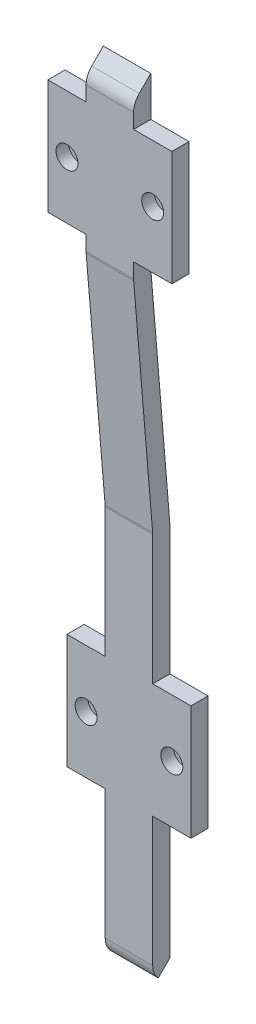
from build123d import *

# Parameters (mm, degrees)
SALIENTE_EXTRUIR1_DEPTH = 5
SALIENTE_EXTRUIR2_DEPTH = 12.431326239
CROQUIS3_W              = 10
CROQUIS3_H              = 30
SALIENTE_EXTRUIR3_DEPTH = 5
CROQUIS4_R              = 1.55
CORTAR_EXTRUIR1_DEPTH   = 140.941176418
CROQUIS5_R              = 2.875
CORTAR_EXTRUIR2_DEPTH   = 3.3
CROQUIS6_R              = 2.875
CORTAR_EXTRUIR3_DEPTH   = 3.3
CORTAR_EXTRUIR4_DEPTH   = 142.958733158


with BuildPart() as part:
    # Croquis1 → Saliente-Extruir1 (new body)
    with BuildSketch(Plane.XY):
        Polygon((21.978213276, 96.910721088), (21.978213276, 126.910721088), (11.978213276, 126.910721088), (11.978213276, 130.771200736), (-0.453112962, 130.771200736), (-0.453112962, 126.910721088), (-10.453112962, 126.910721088), (-10.453112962, 96.910721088), (-0.453112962, 96.910721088), (-0.453112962, 93.050241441), (11.978213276, 93.050241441), (11.978213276, 96.910721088), align=None)
    extrude(amount=-SALIENTE_EXTRUIR1_DEPTH)

    # Croquis2 → Saliente-Extruir2 (add)
    with BuildSketch(Plane(origin=(11.978213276, 0, 0), x_dir=(0, 0, -1), z_dir=(1, 0, 0))):
        with BuildLine():
            Line((5, 130.771200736), (5, 137.842268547))
            Line((5, 137.842268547), (1.464466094, 134.306734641))
            ThreePointArc((1.464466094, 134.306734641), (0.380602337, 132.684617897), (0, 130.771200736))
            Line((0, 130.771200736), (5, 130.771200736))
        make_face()
        with BuildLine():
            Line((0.017271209, 92.635014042), (4.982728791, 33.049523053))
            ThreePointArc((4.982728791, 33.049523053), (4.995680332, 32.842088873), (5, 32.634295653))
            Line((5, 32.634295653), (5, -65.086663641))
            ThreePointArc((5, -65.086663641), (5.380602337, -67.000080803), (6.464466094, -68.622197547))
            Line((6.464466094, -68.622197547), (10, -65.086663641))
            Line((10, -65.086663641), (10, 32.634295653))
            Line((10, 32.634295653), (5, 93.050241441))
            Line((5, 93.050241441), (0, 93.050241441))
            ThreePointArc((0, 93.050241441), (0.004319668, 92.842448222), (0.017271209, 92.635014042))
        make_face()
    extrude(amount=-SALIENTE_EXTRUIR2_DEPTH)

    # Croquis3 → Saliente-Extruir3 (add)
    with BuildSketch(Plane.XY.offset(-5)):
        with Locations((16.978213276, -16.226183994)):
            Rectangle(CROQUIS3_W, CROQUIS3_H)
        with Locations((-5.453112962, -16.226183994)):
            Rectangle(CROQUIS3_W, CROQUIS3_H)
    extrude(amount=-SALIENTE_EXTRUIR3_DEPTH)

    # Croquis4 → Cortar-Extruir1 (cut, through all)
    with BuildSketch(Plane.XY):
        with Locations((-5.453112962, 111.910721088)):
            Circle(CROQUIS4_R)
        with Locations((16.978213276, 111.910721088)):
            Circle(CROQUIS4_R)
        with Locations((-5.453112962, -16.226183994)):
            Circle(CROQUIS4_R)
        with Locations((16.978213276, -16.226183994)):
            Circle(CROQUIS4_R)
    extrude(amount=-CORTAR_EXTRUIR1_DEPTH, mode=Mode.SUBTRACT)

    # Croquis5 → Cortar-Extruir2 (cut)
    with BuildSketch(Plane.XY.offset(-5)):
        with Locations((-5.453112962, -16.226183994)):
            Circle(CROQUIS5_R)
        with Locations((16.978213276, -16.226183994)):
            Circle(CROQUIS5_R)
    extrude(amount=-CORTAR_EXTRUIR2_DEPTH, mode=Mode.SUBTRACT)

    # Croquis6 → Cortar-Extruir3 (cut)
    with BuildSketch(Plane.XY):
        with Locations((-5.453112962, 111.910721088)):
            Circle(CROQUIS6_R)
        with Locations((16.978213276, 111.910721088)):
            Circle(CROQUIS6_R)
    extrude(amount=-CORTAR_EXTRUIR3_DEPTH, mode=Mode.SUBTRACT)

    # Croquis7 → Cortar-Extruir4 (cut, through all)
    with BuildSketch(Plane(origin=(21.978213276, 0, 0), x_dir=(0, 0, -1), z_dir=(1, 0, 0))):
        Polygon((9.5, -65.086663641), (9.5, -65.586663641), (10, -65.086663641), (10, -31.226183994), (10, -1.226183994), (10, 32.634295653), (5, 93.050241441), (5, 96.910721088), (5, 126.910721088), (5, 137.842268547), (4.5, 137.842268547), (4.5, 126.910721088), (4.5, 96.910721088), (4.5, 93.029586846), (9.5, 32.613641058), (9.5, -1.226183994), (9.5, -31.226183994), align=None)
    extrude(amount=-CORTAR_EXTRUIR4_DEPTH, mode=Mode.SUBTRACT)


solid = part.part
